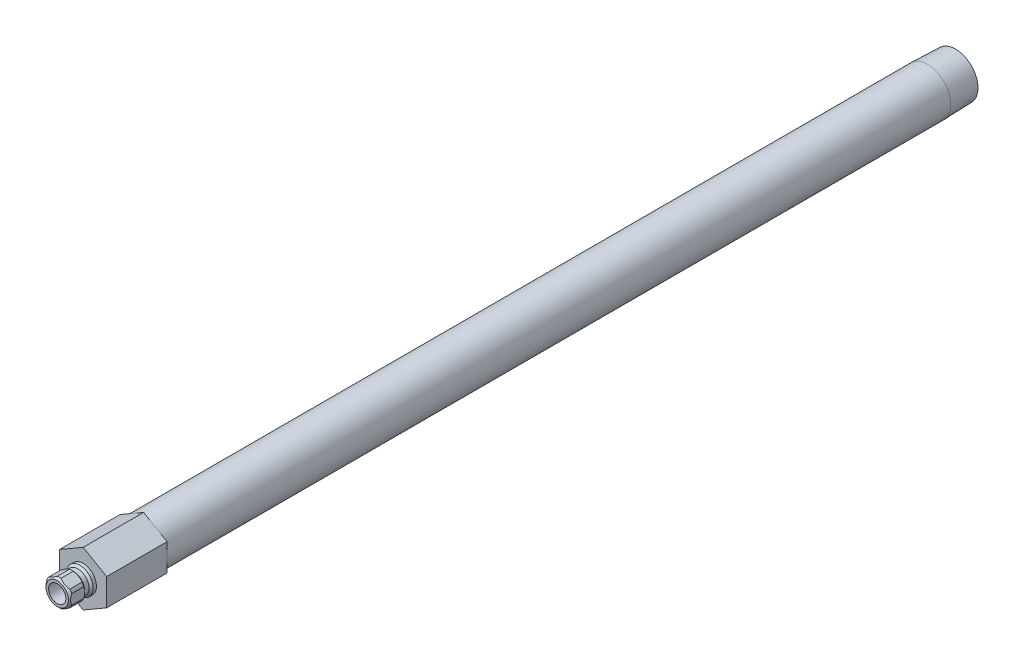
ISO-10303-21;
HEADER;
FILE_DESCRIPTION(('STEP AP214'),'2;1');
FILE_NAME('part.step','',(''),(''),'','','');
FILE_SCHEMA(('AUTOMOTIVE_DESIGN { 1 0 10303 214 1 1 1 1 }'));
ENDSEC;
DATA;
#1=APPLICATION_CONTEXT('core data for automotive mechanical design processes');
#2=APPLICATION_PROTOCOL_DEFINITION('international standard','automotive_design',2000,#1);
#3=PRODUCT_CONTEXT('',#1,'mechanical');
#4=PRODUCT('Part','Part','',(#3));
#5=PRODUCT_RELATED_PRODUCT_CATEGORY('part','',(#4));
#6=PRODUCT_DEFINITION_FORMATION('','',#4);
#7=PRODUCT_DEFINITION_CONTEXT('part definition',#1,'design');
#8=PRODUCT_DEFINITION('design','',#6,#7);
#9=PRODUCT_DEFINITION_SHAPE('','',#8);
#10=(LENGTH_UNIT() NAMED_UNIT(*) SI_UNIT(.MILLI.,.METRE.));
#11=(NAMED_UNIT(*) PLANE_ANGLE_UNIT() SI_UNIT($,.RADIAN.));
#12=(NAMED_UNIT(*) SI_UNIT($,.STERADIAN.) SOLID_ANGLE_UNIT());
#13=UNCERTAINTY_MEASURE_WITH_UNIT(LENGTH_MEASURE(1.E-05),#10,'distance_accuracy_value','');
#14=(GEOMETRIC_REPRESENTATION_CONTEXT(3) GLOBAL_UNCERTAINTY_ASSIGNED_CONTEXT((#13)) GLOBAL_UNIT_ASSIGNED_CONTEXT((#10,
#11,#12)) REPRESENTATION_CONTEXT('',''));
#15=CARTESIAN_POINT('',(0.,0.,0.));
#16=DIRECTION('',(0.,0.,1.));
#17=DIRECTION('',(1.,0.,0.));
#18=AXIS2_PLACEMENT_3D('',#15,#16,#17);
#19=CARTESIAN_POINT('',(0.,0.,0.));
#20=DIRECTION('',(0.,0.,-1.));
#21=DIRECTION('',(0.,1.,0.));
#22=AXIS2_PLACEMENT_3D('',#19,#20,#21);
#23=CYLINDRICAL_SURFACE('',#22,4.8895);
#24=DIRECTION('',(0.,0.,-1.));
#25=VECTOR('',#24,1.);
#26=CARTESIAN_POINT('',(4.5212,1.86170910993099,0.));
#27=LINE('',#26,#25);
#28=CARTESIAN_POINT('',(4.5212,1.86170910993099,4.318));
#29=VERTEX_POINT('',#28);
#30=CARTESIAN_POINT('',(4.5212,1.86170910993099,8.763));
#31=VERTEX_POINT('',#30);
#32=EDGE_CURVE('E404',#29,#31,#27,.F.);
#33=ORIENTED_EDGE('',*,*,#32,.F.);
#34=CARTESIAN_POINT('',(0.,0.,4.318));
#35=DIRECTION('',(0.,0.,-1.));
#36=DIRECTION('',(0.,1.,0.));
#37=AXIS2_PLACEMENT_3D('',#34,#35,#36);
#38=CIRCLE('',#37,4.8895);
#39=CARTESIAN_POINT('',(3.87288738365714,2.98461950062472,4.318));
#40=VERTEX_POINT('',#39);
#41=EDGE_CURVE('E206',#40,#29,#38,.T.);
#42=ORIENTED_EDGE('',*,*,#41,.F.);
#43=DIRECTION('',(0.,0.,-1.));
#44=VECTOR('',#43,1.);
#45=CARTESIAN_POINT('',(3.87288738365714,2.98461950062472,0.));
#46=LINE('',#45,#44);
#47=CARTESIAN_POINT('',(3.87288738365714,2.98461950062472,8.763));
#48=VERTEX_POINT('',#47);
#49=EDGE_CURVE('E392',#48,#40,#46,.T.);
#50=ORIENTED_EDGE('',*,*,#49,.F.);
#51=CARTESIAN_POINT('',(0.,0.,8.763));
#52=DIRECTION('',(0.,0.,-1.));
#53=DIRECTION('',(0.,1.,0.));
#54=AXIS2_PLACEMENT_3D('',#51,#52,#53);
#55=CIRCLE('',#54,4.8895);
#56=EDGE_CURVE('E193',#48,#31,#55,.T.);
#57=ORIENTED_EDGE('',*,*,#56,.T.);
#58=EDGE_LOOP('',(#33,#42,#50,#57));
#59=FACE_BOUND('',#58,.T.);
#60=ADVANCED_FACE('F34',(#59),#23,.T.);
#61=DIRECTION('',(0.,0.,-1.));
#62=VECTOR('',#61,1.);
#63=CARTESIAN_POINT('',(0.648312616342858,4.84632861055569,0.));
#64=LINE('',#63,#62);
#65=CARTESIAN_POINT('',(0.648312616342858,4.84632861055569,4.318));
#66=VERTEX_POINT('',#65);
#67=CARTESIAN_POINT('',(0.648312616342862,4.84632861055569,8.763));
#68=VERTEX_POINT('',#67);
#69=EDGE_CURVE('E311',#66,#68,#64,.F.);
#70=ORIENTED_EDGE('',*,*,#69,.F.);
#71=CARTESIAN_POINT('',(-0.648312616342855,4.84632861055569,4.318));
#72=VERTEX_POINT('',#71);
#73=EDGE_CURVE('E202',#72,#66,#38,.T.);
#74=ORIENTED_EDGE('',*,*,#73,.F.);
#75=DIRECTION('',(0.,0.,-1.));
#76=VECTOR('',#75,1.);
#77=CARTESIAN_POINT('',(-0.648312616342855,4.84632861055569,0.));
#78=LINE('',#77,#76);
#79=CARTESIAN_POINT('',(-0.648312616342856,4.84632861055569,8.763));
#80=VERTEX_POINT('',#79);
#81=EDGE_CURVE('E391',#80,#72,#78,.T.);
#82=ORIENTED_EDGE('',*,*,#81,.F.);
#83=EDGE_CURVE('E196',#80,#68,#55,.T.);
#84=ORIENTED_EDGE('',*,*,#83,.T.);
#85=EDGE_LOOP('',(#70,#74,#82,#84));
#86=FACE_BOUND('',#85,.T.);
#87=ADVANCED_FACE('F345',(#86),#23,.T.);
#88=DIRECTION('',(0.,0.,-1.));
#89=VECTOR('',#88,1.);
#90=CARTESIAN_POINT('',(-3.87288738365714,2.98461950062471,0.));
#91=LINE('',#90,#89);
#92=CARTESIAN_POINT('',(-3.87288738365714,2.98461950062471,4.318));
#93=VERTEX_POINT('',#92);
#94=CARTESIAN_POINT('',(-3.87288738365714,2.98461950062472,8.763));
#95=VERTEX_POINT('',#94);
#96=EDGE_CURVE('E54',#93,#95,#91,.F.);
#97=ORIENTED_EDGE('',*,*,#96,.F.);
#98=CARTESIAN_POINT('',(-4.5212,1.86170910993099,4.318));
#99=VERTEX_POINT('',#98);
#100=EDGE_CURVE('E205',#99,#93,#38,.T.);
#101=ORIENTED_EDGE('',*,*,#100,.F.);
#102=DIRECTION('',(0.,0.,-1.));
#103=VECTOR('',#102,1.);
#104=CARTESIAN_POINT('',(-4.5212,1.86170910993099,0.));
#105=LINE('',#104,#103);
#106=CARTESIAN_POINT('',(-4.5212,1.86170910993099,8.763));
#107=VERTEX_POINT('',#106);
#108=EDGE_CURVE('E378',#107,#99,#105,.T.);
#109=ORIENTED_EDGE('',*,*,#108,.F.);
#110=EDGE_CURVE('E195',#107,#95,#55,.T.);
#111=ORIENTED_EDGE('',*,*,#110,.T.);
#112=EDGE_LOOP('',(#97,#101,#109,#111));
#113=FACE_BOUND('',#112,.T.);
#114=ADVANCED_FACE('F350',(#113),#23,.T.);
#115=DIRECTION('',(0.,0.,-1.));
#116=VECTOR('',#115,1.);
#117=CARTESIAN_POINT('',(-4.5212,-1.86170910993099,0.));
#118=LINE('',#117,#116);
#119=CARTESIAN_POINT('',(-4.5212,-1.86170910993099,4.318));
#120=VERTEX_POINT('',#119);
#121=CARTESIAN_POINT('',(-4.5212,-1.86170910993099,8.763));
#122=VERTEX_POINT('',#121);
#123=EDGE_CURVE('E62',#120,#122,#118,.F.);
#124=ORIENTED_EDGE('',*,*,#123,.F.);
#125=CARTESIAN_POINT('',(-3.87288738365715,-2.98461950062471,4.318));
#126=VERTEX_POINT('',#125);
#127=EDGE_CURVE('E377',#126,#120,#38,.T.);
#128=ORIENTED_EDGE('',*,*,#127,.F.);
#129=DIRECTION('',(0.,0.,-1.));
#130=VECTOR('',#129,1.);
#131=CARTESIAN_POINT('',(-3.87288738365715,-2.98461950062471,0.));
#132=LINE('',#131,#130);
#133=CARTESIAN_POINT('',(-3.87288738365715,-2.98461950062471,8.763));
#134=VERTEX_POINT('',#133);
#135=EDGE_CURVE('E265',#134,#126,#132,.T.);
#136=ORIENTED_EDGE('',*,*,#135,.F.);
#137=EDGE_CURVE('E191',#134,#122,#55,.T.);
#138=ORIENTED_EDGE('',*,*,#137,.T.);
#139=EDGE_LOOP('',(#124,#128,#136,#138));
#140=FACE_BOUND('',#139,.T.);
#141=ADVANCED_FACE('F362',(#140),#23,.T.);
#142=DIRECTION('',(0.,0.,-1.));
#143=VECTOR('',#142,1.);
#144=CARTESIAN_POINT('',(-0.648312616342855,-4.84632861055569,0.));
#145=LINE('',#144,#143);
#146=CARTESIAN_POINT('',(-0.648312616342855,-4.84632861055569,4.318));
#147=VERTEX_POINT('',#146);
#148=CARTESIAN_POINT('',(-0.648312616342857,-4.84632861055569,8.763));
#149=VERTEX_POINT('',#148);
#150=EDGE_CURVE('E394',#147,#149,#145,.F.);
#151=ORIENTED_EDGE('',*,*,#150,.F.);
#152=CARTESIAN_POINT('',(0.648312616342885,-4.84632861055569,4.318));
#153=VERTEX_POINT('',#152);
#154=EDGE_CURVE('E183',#153,#147,#38,.T.);
#155=ORIENTED_EDGE('',*,*,#154,.F.);
#156=DIRECTION('',(0.,0.,-1.));
#157=VECTOR('',#156,1.);
#158=CARTESIAN_POINT('',(0.648312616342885,-4.84632861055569,0.));
#159=LINE('',#158,#157);
#160=CARTESIAN_POINT('',(0.648312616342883,-4.84632861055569,8.763));
#161=VERTEX_POINT('',#160);
#162=EDGE_CURVE('E165',#161,#153,#159,.T.);
#163=ORIENTED_EDGE('',*,*,#162,.F.);
#164=EDGE_CURVE('E181',#161,#149,#55,.T.);
#165=ORIENTED_EDGE('',*,*,#164,.T.);
#166=EDGE_LOOP('',(#151,#155,#163,#165));
#167=FACE_BOUND('',#166,.T.);
#168=ADVANCED_FACE('F180',(#167),#23,.T.);
#169=CARTESIAN_POINT('',(0.,0.,0.));
#170=DIRECTION('',(0.,0.,-1.));
#171=DIRECTION('',(0.,1.,0.));
#172=AXIS2_PLACEMENT_3D('',#169,#170,#171);
#173=CYLINDRICAL_SURFACE('',#172,8.57249999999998);
#174=CARTESIAN_POINT('',(0.,0.,-310.3372));
#175=DIRECTION('',(0.,0.,-1.));
#176=DIRECTION('',(0.,1.,0.));
#177=AXIS2_PLACEMENT_3D('',#174,#175,#176);
#178=CIRCLE('',#177,8.57249999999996);
#179=CARTESIAN_POINT('',(0.,8.5725,-310.3372));
#180=VERTEX_POINT('',#179);
#181=EDGE_CURVE('E219',#180,#180,#178,.T.);
#182=ORIENTED_EDGE('',*,*,#181,.F.);
#183=EDGE_LOOP('',(#182));
#184=FACE_BOUND('',#183,.T.);
#185=CARTESIAN_POINT('',(0.,0.,-22.225));
#186=DIRECTION('',(0.,0.,1.));
#187=DIRECTION('',(1.,0.,0.));
#188=AXIS2_PLACEMENT_3D('',#185,#186,#187);
#189=CIRCLE('',#188,8.57249999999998);
#190=CARTESIAN_POINT('',(8.57249999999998,0.,-22.225));
#191=VERTEX_POINT('',#190);
#192=EDGE_CURVE('E233',#191,#191,#189,.F.);
#193=ORIENTED_EDGE('',*,*,#192,.T.);
#194=EDGE_LOOP('',(#193));
#195=FACE_BOUND('',#194,.T.);
#196=ADVANCED_FACE('F361',(#184,#195),#173,.T.);
#197=CARTESIAN_POINT('',(0.,0.,0.));
#198=DIRECTION('',(0.,0.,-1.));
#199=DIRECTION('',(0.,1.,0.));
#200=AXIS2_PLACEMENT_3D('',#197,#198,#199);
#201=CYLINDRICAL_SURFACE('',#200,3.175);
#202=CARTESIAN_POINT('',(0.,0.,9.525));
#203=DIRECTION('',(0.,0.,-1.));
#204=DIRECTION('',(0.,1.,0.));
#205=AXIS2_PLACEMENT_3D('',#202,#203,#204);
#206=CIRCLE('',#205,3.175);
#207=CARTESIAN_POINT('',(0.,3.175,9.525));
#208=VERTEX_POINT('',#207);
#209=EDGE_CURVE('E235',#208,#208,#206,.T.);
#210=ORIENTED_EDGE('',*,*,#209,.F.);
#211=EDGE_LOOP('',(#210));
#212=FACE_BOUND('',#211,.T.);
#213=CARTESIAN_POINT('',(0.,0.,-22.225));
#214=DIRECTION('',(0.,0.,-1.));
#215=DIRECTION('',(0.,1.,0.));
#216=AXIS2_PLACEMENT_3D('',#213,#214,#215);
#217=CIRCLE('',#216,3.175);
#218=CARTESIAN_POINT('',(0.,3.175,-22.225));
#219=VERTEX_POINT('',#218);
#220=EDGE_CURVE('E174',#219,#219,#217,.T.);
#221=ORIENTED_EDGE('',*,*,#220,.T.);
#222=EDGE_LOOP('',(#221));
#223=FACE_BOUND('',#222,.T.);
#224=ADVANCED_FACE('F36',(#212,#223),#201,.F.);
#225=CARTESIAN_POINT('',(0.,3.175,-22.225));
#226=DIRECTION('',(0.,0.,-1.));
#227=DIRECTION('',(0.,1.,0.));
#228=AXIS2_PLACEMENT_3D('',#225,#226,#227);
#229=PLANE('',#228);
#230=CARTESIAN_POINT('',(0.,0.,-22.225));
#231=DIRECTION('',(0.,0.,-1.));
#232=DIRECTION('',(0.,1.,0.));
#233=AXIS2_PLACEMENT_3D('',#230,#231,#232);
#234=CIRCLE('',#233,6.2611);
#235=CARTESIAN_POINT('',(0.,6.2611,-22.225));
#236=VERTEX_POINT('',#235);
#237=EDGE_CURVE('E228',#236,#236,#234,.T.);
#238=ORIENTED_EDGE('',*,*,#237,.T.);
#239=EDGE_LOOP('',(#238));
#240=FACE_BOUND('',#239,.T.);
#241=ORIENTED_EDGE('',*,*,#220,.F.);
#242=EDGE_LOOP('',(#241));
#243=FACE_BOUND('',#242,.T.);
#244=ADVANCED_FACE('F533',(#240,#243),#229,.T.);
#245=CARTESIAN_POINT('',(0.,0.,0.));
#246=DIRECTION('',(0.,0.,-1.));
#247=DIRECTION('',(0.,1.,0.));
#248=AXIS2_PLACEMENT_3D('',#245,#246,#247);
#249=CYLINDRICAL_SURFACE('',#248,6.26109999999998);
#250=CARTESIAN_POINT('',(0.,0.,-320.675));
#251=DIRECTION('',(0.,0.,-1.));
#252=DIRECTION('',(0.,1.,0.));
#253=AXIS2_PLACEMENT_3D('',#250,#251,#252);
#254=CIRCLE('',#253,6.26109999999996);
#255=CARTESIAN_POINT('',(0.,6.2611,-320.675));
#256=VERTEX_POINT('',#255);
#257=EDGE_CURVE('E225',#256,#256,#254,.T.);
#258=ORIENTED_EDGE('',*,*,#257,.T.);
#259=EDGE_LOOP('',(#258));
#260=FACE_BOUND('',#259,.T.);
#261=ORIENTED_EDGE('',*,*,#237,.F.);
#262=EDGE_LOOP('',(#261));
#263=FACE_BOUND('',#262,.T.);
#264=ADVANCED_FACE('F530',(#260,#263),#249,.F.);
#265=CARTESIAN_POINT('',(0.,8.24944566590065,-320.675));
#266=DIRECTION('',(0.,0.,-1.));
#267=DIRECTION('',(0.,1.,0.));
#268=AXIS2_PLACEMENT_3D('',#265,#266,#267);
#269=PLANE('',#268);
#270=CARTESIAN_POINT('',(0.,0.,-320.675));
#271=DIRECTION('',(0.,0.,-1.));
#272=DIRECTION('',(0.,1.,0.));
#273=AXIS2_PLACEMENT_3D('',#270,#271,#272);
#274=CIRCLE('',#273,8.24944566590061);
#275=CARTESIAN_POINT('',(0.,8.24944566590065,-320.675));
#276=VERTEX_POINT('',#275);
#277=EDGE_CURVE('E222',#276,#276,#274,.T.);
#278=ORIENTED_EDGE('',*,*,#277,.T.);
#279=EDGE_LOOP('',(#278));
#280=FACE_BOUND('',#279,.T.);
#281=ORIENTED_EDGE('',*,*,#257,.F.);
#282=EDGE_LOOP('',(#281));
#283=FACE_BOUND('',#282,.T.);
#284=ADVANCED_FACE('F524',(#280,#283),#269,.T.);
#285=CARTESIAN_POINT('',(0.,0.,-320.675));
#286=DIRECTION('',(0.,0.,1.));
#287=DIRECTION('',(0.,-1.,0.));
#288=AXIS2_PLACEMENT_3D('',#285,#286,#287);
#289=CONICAL_SURFACE('',#288,8.24944566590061,0.0312396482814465);
#290=ORIENTED_EDGE('',*,*,#181,.T.);
#291=EDGE_LOOP('',(#290));
#292=FACE_BOUND('',#291,.T.);
#293=ORIENTED_EDGE('',*,*,#277,.F.);
#294=EDGE_LOOP('',(#293));
#295=FACE_BOUND('',#294,.T.);
#296=ADVANCED_FACE('F514',(#292,#295),#289,.T.);
#297=CARTESIAN_POINT('',(0.,4.8895,0.));
#298=DIRECTION('',(0.,0.,1.));
#299=DIRECTION('',(0.,-1.,0.));
#300=AXIS2_PLACEMENT_3D('',#297,#298,#299);
#301=PLANE('',#300);
#302=CARTESIAN_POINT('',(0.,0.,0.));
#303=DIRECTION('',(0.,0.,-1.));
#304=DIRECTION('',(0.,1.,0.));
#305=AXIS2_PLACEMENT_3D('',#302,#303,#304);
#306=CIRCLE('',#305,4.8895);
#307=CARTESIAN_POINT('',(0.,4.8895,0.));
#308=VERTEX_POINT('',#307);
#309=EDGE_CURVE('E216',#308,#308,#306,.T.);
#310=ORIENTED_EDGE('',*,*,#309,.T.);
#311=EDGE_LOOP('',(#310));
#312=FACE_BOUND('',#311,.T.);
#313=DIRECTION('',(-0.866025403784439,-0.5,0.));
#314=VECTOR('',#313,1.);
#315=CARTESIAN_POINT('',(0.,9.97199384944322,0.));
#316=LINE('',#315,#314);
#317=CARTESIAN_POINT('',(0.,9.97199384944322,0.));
#318=VERTEX_POINT('',#317);
#319=CARTESIAN_POINT('',(-8.636,4.98599692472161,0.));
#320=VERTEX_POINT('',#319);
#321=EDGE_CURVE('E409',#318,#320,#316,.T.);
#322=ORIENTED_EDGE('',*,*,#321,.T.);
#323=DIRECTION('',(0.,-1.,0.));
#324=VECTOR('',#323,1.);
#325=CARTESIAN_POINT('',(-8.636,4.98599692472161,0.));
#326=LINE('',#325,#324);
#327=CARTESIAN_POINT('',(-8.636,-4.98599692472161,0.));
#328=VERTEX_POINT('',#327);
#329=EDGE_CURVE('E436',#320,#328,#326,.T.);
#330=ORIENTED_EDGE('',*,*,#329,.T.);
#331=DIRECTION('',(0.866025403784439,-0.5,0.));
#332=VECTOR('',#331,1.);
#333=CARTESIAN_POINT('',(-8.636,-4.98599692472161,0.));
#334=LINE('',#333,#332);
#335=CARTESIAN_POINT('',(0.,-9.97199384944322,0.));
#336=VERTEX_POINT('',#335);
#337=EDGE_CURVE('E439',#328,#336,#334,.T.);
#338=ORIENTED_EDGE('',*,*,#337,.T.);
#339=DIRECTION('',(0.866025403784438,0.5,0.));
#340=VECTOR('',#339,1.);
#341=CARTESIAN_POINT('',(0.,-9.97199384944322,0.));
#342=LINE('',#341,#340);
#343=CARTESIAN_POINT('',(8.636,-4.98599692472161,0.));
#344=VERTEX_POINT('',#343);
#345=EDGE_CURVE('E442',#336,#344,#342,.T.);
#346=ORIENTED_EDGE('',*,*,#345,.T.);
#347=DIRECTION('',(0.,1.,0.));
#348=VECTOR('',#347,1.);
#349=CARTESIAN_POINT('',(8.636,-4.98599692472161,0.));
#350=LINE('',#349,#348);
#351=CARTESIAN_POINT('',(8.636,4.98599692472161,0.));
#352=VERTEX_POINT('',#351);
#353=EDGE_CURVE('E445',#344,#352,#350,.T.);
#354=ORIENTED_EDGE('',*,*,#353,.T.);
#355=DIRECTION('',(-0.866025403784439,0.5,0.));
#356=VECTOR('',#355,1.);
#357=CARTESIAN_POINT('',(8.636,4.98599692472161,0.));
#358=LINE('',#357,#356);
#359=EDGE_CURVE('E418',#352,#318,#358,.T.);
#360=ORIENTED_EDGE('',*,*,#359,.T.);
#361=EDGE_LOOP('',(#322,#330,#338,#346,#354,#360));
#362=FACE_BOUND('',#361,.T.);
#363=ADVANCED_FACE('F511',(#312,#362),#301,.T.);
#364=CARTESIAN_POINT('',(0.,0.,0.));
#365=DIRECTION('',(0.,0.,-1.));
#366=DIRECTION('',(0.,1.,0.));
#367=AXIS2_PLACEMENT_3D('',#364,#365,#366);
#368=CYLINDRICAL_SURFACE('',#367,4.8895);
#369=CARTESIAN_POINT('',(0.,0.,1.2065));
#370=DIRECTION('',(0.,0.,-1.));
#371=DIRECTION('',(0.,1.,0.));
#372=AXIS2_PLACEMENT_3D('',#369,#370,#371);
#373=CIRCLE('',#372,4.8895);
#374=CARTESIAN_POINT('',(0.,4.8895,1.2065));
#375=VERTEX_POINT('',#374);
#376=EDGE_CURVE('E213',#375,#375,#373,.T.);
#377=ORIENTED_EDGE('',*,*,#376,.T.);
#378=EDGE_LOOP('',(#377));
#379=FACE_BOUND('',#378,.T.);
#380=ORIENTED_EDGE('',*,*,#309,.F.);
#381=EDGE_LOOP('',(#380));
#382=FACE_BOUND('',#381,.T.);
#383=ADVANCED_FACE('F513',(#379,#382),#368,.T.);
#384=CARTESIAN_POINT('',(0.,0.,1.2065));
#385=DIRECTION('',(0.,0.,-1.));
#386=DIRECTION('',(0.,1.,0.));
#387=AXIS2_PLACEMENT_3D('',#384,#385,#386);
#388=CONICAL_SURFACE('',#387,4.8895,0.785398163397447);
#389=CARTESIAN_POINT('',(0.,0.,1.9685));
#390=DIRECTION('',(0.,0.,-1.));
#391=DIRECTION('',(0.,1.,0.));
#392=AXIS2_PLACEMENT_3D('',#389,#390,#391);
#393=CIRCLE('',#392,4.1275);
#394=CARTESIAN_POINT('',(0.,4.1275,1.9685));
#395=VERTEX_POINT('',#394);
#396=EDGE_CURVE('E210',#395,#395,#393,.T.);
#397=ORIENTED_EDGE('',*,*,#396,.T.);
#398=EDGE_LOOP('',(#397));
#399=FACE_BOUND('',#398,.T.);
#400=ORIENTED_EDGE('',*,*,#376,.F.);
#401=EDGE_LOOP('',(#400));
#402=FACE_BOUND('',#401,.T.);
#403=ADVANCED_FACE('F521',(#399,#402),#388,.T.);
#404=CARTESIAN_POINT('',(0.,0.,0.));
#405=DIRECTION('',(0.,0.,-1.));
#406=DIRECTION('',(0.,1.,0.));
#407=AXIS2_PLACEMENT_3D('',#404,#405,#406);
#408=CYLINDRICAL_SURFACE('',#407,4.1275);
#409=CARTESIAN_POINT('',(0.,0.,3.556));
#410=DIRECTION('',(0.,0.,-1.));
#411=DIRECTION('',(0.,1.,0.));
#412=AXIS2_PLACEMENT_3D('',#409,#410,#411);
#413=CIRCLE('',#412,4.1275);
#414=CARTESIAN_POINT('',(0.,4.1275,3.556));
#415=VERTEX_POINT('',#414);
#416=EDGE_CURVE('E207',#415,#415,#413,.T.);
#417=ORIENTED_EDGE('',*,*,#416,.T.);
#418=EDGE_LOOP('',(#417));
#419=FACE_BOUND('',#418,.T.);
#420=ORIENTED_EDGE('',*,*,#396,.F.);
#421=EDGE_LOOP('',(#420));
#422=FACE_BOUND('',#421,.T.);
#423=ADVANCED_FACE('F272',(#419,#422),#408,.T.);
#424=CARTESIAN_POINT('',(0.,0.,3.556));
#425=DIRECTION('',(0.,0.,1.));
#426=DIRECTION('',(0.,-1.,0.));
#427=AXIS2_PLACEMENT_3D('',#424,#425,#426);
#428=CONICAL_SURFACE('',#427,4.1275,0.785398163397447);
#429=CARTESIAN_POINT('',(4.52119999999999,-5.15925306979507,6.28846659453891));
#430=CARTESIAN_POINT('',(4.52119999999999,-5.03341781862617,6.19384981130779));
#431=CARTESIAN_POINT('',(4.52119999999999,-4.90687282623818,6.100161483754));
#432=CARTESIAN_POINT('',(4.52119999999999,-4.65208542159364,5.91505573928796));
#433=CARTESIAN_POINT('',(4.52119999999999,-4.52384258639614,5.8236389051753));
#434=CARTESIAN_POINT('',(4.52119999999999,-4.26444371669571,5.64284060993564));
#435=CARTESIAN_POINT('',(4.52119999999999,-4.1332728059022,5.5534804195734));
#436=CARTESIAN_POINT('',(4.52119999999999,-3.86869655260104,5.37814219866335));
#437=CARTESIAN_POINT('',(4.52119999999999,-3.73529136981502,5.29216392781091));
#438=CARTESIAN_POINT('',(4.52119999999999,-3.45835736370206,5.11964219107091));
#439=CARTESIAN_POINT('',(4.52119999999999,-3.31467977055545,5.03333631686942));
#440=CARTESIAN_POINT('',(4.52119999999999,-3.02397608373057,4.86646929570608));
#441=CARTESIAN_POINT('',(4.52119999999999,-2.87694947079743,4.78590904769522));
#442=CARTESIAN_POINT('',(4.52119999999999,-2.57957206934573,4.6322757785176));
#443=CARTESIAN_POINT('',(4.52119999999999,-2.42923274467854,4.55918074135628));
#444=CARTESIAN_POINT('',(4.52119999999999,-2.12448469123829,4.4221138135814));
#445=CARTESIAN_POINT('',(4.52119999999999,-1.97007782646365,4.35813782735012));
#446=CARTESIAN_POINT('',(4.52119999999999,-1.66898205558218,4.24604782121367));
#447=CARTESIAN_POINT('',(4.52119999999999,-1.52260919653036,4.19709368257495));
#448=CARTESIAN_POINT('',(4.52119999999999,-1.22638031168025,4.11093488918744));
#449=CARTESIAN_POINT('',(4.52119999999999,-1.07652404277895,4.07373105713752));
#450=CARTESIAN_POINT('',(4.52119999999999,-0.776693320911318,4.01362130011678));
#451=CARTESIAN_POINT('',(4.52119999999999,-0.626768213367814,3.99047322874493));
#452=CARTESIAN_POINT('',(4.52119999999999,-0.325366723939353,3.95891692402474));
#453=CARTESIAN_POINT('',(4.52119999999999,-0.173890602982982,3.95050625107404));
#454=CARTESIAN_POINT('',(4.52119999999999,0.123852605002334,3.94903068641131));
#455=CARTESIAN_POINT('',(4.52119999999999,0.270117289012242,3.95544130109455));
#456=CARTESIAN_POINT('',(4.52119999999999,0.561370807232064,3.98210770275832));
#457=CARTESIAN_POINT('',(4.5212,0.706359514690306,4.0023648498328));
#458=CARTESIAN_POINT('',(4.5212,0.996462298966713,4.05597163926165));
#459=CARTESIAN_POINT('',(4.5212,1.14153485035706,4.08954247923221));
#460=CARTESIAN_POINT('',(4.5212,1.42852462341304,4.1680002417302));
#461=CARTESIAN_POINT('',(4.5212,1.57044212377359,4.21288616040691));
#462=CARTESIAN_POINT('',(4.5212,1.86505501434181,4.31714129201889));
#463=CARTESIAN_POINT('',(4.5212,2.01739126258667,4.377515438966));
#464=CARTESIAN_POINT('',(4.5212,2.31809735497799,4.50751823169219));
#465=CARTESIAN_POINT('',(4.5212,2.46646529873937,4.57715121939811));
#466=CARTESIAN_POINT('',(4.5212,2.75996557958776,4.72401353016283));
#467=CARTESIAN_POINT('',(4.5212,2.9050858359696,4.80126680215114));
#468=CARTESIAN_POINT('',(4.5212,3.19198335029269,4.96166050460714));
#469=CARTESIAN_POINT('',(4.5212,3.33376113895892,5.04479999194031));
#470=CARTESIAN_POINT('',(4.5212,3.60742153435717,5.21154136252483));
#471=CARTESIAN_POINT('',(4.5212,3.73944496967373,5.29491333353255));
#472=CARTESIAN_POINT('',(4.5212,4.00122581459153,5.46515273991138));
#473=CARTESIAN_POINT('',(4.5212,4.13098305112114,5.55202044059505));
#474=CARTESIAN_POINT('',(4.5212,4.38747396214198,5.72790624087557));
#475=CARTESIAN_POINT('',(4.5212,4.51422365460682,5.81690106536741));
#476=CARTESIAN_POINT('',(4.5212,4.76599253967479,5.99723636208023));
#477=CARTESIAN_POINT('',(4.5212,4.89101219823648,6.08857618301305));
#478=CARTESIAN_POINT('',(4.5212,5.0153077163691,6.18087446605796));
#479=B_SPLINE_CURVE_WITH_KNOTS('',3,(#429,#430,#431,#432,#433,#434,#435,#436,#437,#438,#439,
#440,#441,#442,#443,#444,#445,#446,#447,#448,#449,#450,#451,#452,#453,#454,#455,#456,#457,#458,
#459,#460,#461,#462,#463,#464,#465,#466,#467,#468,#469,#470,#471,#472,#473,#474,#475,#476,#477,
#478),.UNSPECIFIED.,.F.,.F.,(4,2,2,2,2,2,2,2,2,2,2,2,2,2,2,2,2,2,2,2,2,2,2,2,4),(0.,
0.472324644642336,0.944769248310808,1.42087610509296,1.89694907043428,2.39966187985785,
2.90245317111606,3.40371602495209,3.90475303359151,4.36737130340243,4.83002195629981,
5.28445770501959,5.73881822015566,6.17734710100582,6.61591906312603,7.06210522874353,
7.5082518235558,7.99945943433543,8.49089821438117,8.98393391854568,9.4768908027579,
9.94525924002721,10.4136632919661,10.8782525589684,11.3427141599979),.UNSPECIFIED.);
#480=CARTESIAN_POINT('',(4.52119999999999,-1.861709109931,4.318));
#481=VERTEX_POINT('',#480);
#482=EDGE_CURVE('E407',#481,#29,#479,.T.);
#483=ORIENTED_EDGE('',*,*,#482,.F.);
#484=CARTESIAN_POINT('',(3.87288738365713,-2.98461950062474,4.318));
#485=VERTEX_POINT('',#484);
#486=EDGE_CURVE('E385',#481,#485,#38,.T.);
#487=ORIENTED_EDGE('',*,*,#486,.T.);
#488=CARTESIAN_POINT('',(0.647857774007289,-4.84659121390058,4.3182));
#489=CARTESIAN_POINT('',(0.775261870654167,-4.77303442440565,4.26213711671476));
#490=CARTESIAN_POINT('',(0.904457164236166,-4.69844348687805,4.21102627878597));
#491=CARTESIAN_POINT('',(1.16629518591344,-4.5472712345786,4.1207431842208));
#492=CARTESIAN_POINT('',(1.29894624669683,-4.47068510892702,4.08160338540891));
#493=CARTESIAN_POINT('',(1.56203676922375,-4.31878972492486,4.01877592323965));
#494=CARTESIAN_POINT('',(1.69238331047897,-4.24353411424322,3.99458163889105));
#495=CARTESIAN_POINT('',(1.95434729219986,-4.09228913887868,3.96102228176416));
#496=CARTESIAN_POINT('',(2.08596281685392,-4.01630088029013,3.95163757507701));
#497=CARTESIAN_POINT('',(2.3562305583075,-3.86026172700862,3.94821923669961));
#498=CARTESIAN_POINT('',(2.49489129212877,-3.78020591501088,3.95501290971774));
#499=CARTESIAN_POINT('',(2.7710334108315,-3.62077518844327,3.9851849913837));
#500=CARTESIAN_POINT('',(2.90851272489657,-3.5414014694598,4.00858815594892));
#501=CARTESIAN_POINT('',(3.18622016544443,-3.38106700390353,4.07155129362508));
#502=CARTESIAN_POINT('',(3.32634361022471,-3.30016669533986,4.11171074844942));
#503=CARTESIAN_POINT('',(3.60275664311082,-3.14057955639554,4.20550294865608));
#504=CARTESIAN_POINT('',(3.73905611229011,-3.06188702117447,4.25909654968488));
#505=CARTESIAN_POINT('',(3.87334222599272,-2.98435689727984,4.3182));
#506=B_SPLINE_CURVE_WITH_KNOTS('',3,(#488,#489,#490,#491,#492,#493,#494,#495,#496,#497,#498,
#499,#500,#501,#502,#503,#504,#505),.UNSPECIFIED.,.F.,.F.,(4,2,2,2,2,2,2,2,4),(0.,
0.472469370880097,0.946208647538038,1.40285320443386,1.85889185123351,2.33874707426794,
2.81931901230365,3.31879975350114,3.81684169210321),.UNSPECIFIED.);
#507=EDGE_CURVE('E258',#153,#485,#506,.T.);
#508=ORIENTED_EDGE('',*,*,#507,.F.);
#509=ORIENTED_EDGE('',*,*,#154,.T.);
#510=CARTESIAN_POINT('',(-3.87334222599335,-2.98435689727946,4.31820000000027));
#511=CARTESIAN_POINT('',(-3.74593812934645,-3.05791368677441,4.262137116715));
#512=CARTESIAN_POINT('',(-3.61674283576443,-3.13250462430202,4.21102627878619));
#513=CARTESIAN_POINT('',(-3.35490481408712,-3.2836768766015,4.12074318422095));
#514=CARTESIAN_POINT('',(-3.2222537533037,-3.36026300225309,4.08160338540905));
#515=CARTESIAN_POINT('',(-2.95916323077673,-3.51215838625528,4.01877592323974));
#516=CARTESIAN_POINT('',(-2.82881668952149,-3.58741399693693,3.99458163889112));
#517=CARTESIAN_POINT('',(-2.56685270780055,-3.73865897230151,3.96102228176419));
#518=CARTESIAN_POINT('',(-2.43523718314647,-3.81464723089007,3.95163757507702));
#519=CARTESIAN_POINT('',(-2.16496944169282,-3.97068638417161,3.94821923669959));
#520=CARTESIAN_POINT('',(-2.02630870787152,-4.05074219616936,3.9550129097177));
#521=CARTESIAN_POINT('',(-1.75016658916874,-4.21017292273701,3.98518499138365));
#522=CARTESIAN_POINT('',(-1.61268727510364,-4.2895466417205,4.00858815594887));
#523=CARTESIAN_POINT('',(-1.33497983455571,-4.44988110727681,4.07155129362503));
#524=CARTESIAN_POINT('',(-1.1948563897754,-4.5307814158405,4.11171074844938));
#525=CARTESIAN_POINT('',(-0.918443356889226,-4.69036855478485,4.20550294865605));
#526=CARTESIAN_POINT('',(-0.782143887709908,-4.76906109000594,4.25909654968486));
#527=CARTESIAN_POINT('',(-0.647857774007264,-4.84659121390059,4.3182));
#528=B_SPLINE_CURVE_WITH_KNOTS('',3,(#510,#511,#512,#513,#514,#515,#516,#517,#518,#519,#520,
#521,#522,#523,#524,#525,#526,#527),.UNSPECIFIED.,.F.,.F.,(4,2,2,2,2,2,2,2,4),(0.,
0.472469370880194,0.946208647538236,1.40285320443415,1.85889185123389,2.33874707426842,
2.81931901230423,3.31879975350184,3.81684169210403),.UNSPECIFIED.);
#529=EDGE_CURVE('E281',#126,#147,#528,.T.);
#530=ORIENTED_EDGE('',*,*,#529,.F.);
#531=ORIENTED_EDGE('',*,*,#127,.T.);
#532=CARTESIAN_POINT('',(-4.5212,-5.15925306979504,6.2884665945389));
#533=CARTESIAN_POINT('',(-4.5212,-5.03341781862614,6.19384981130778));
#534=CARTESIAN_POINT('',(-4.5212,-4.90687282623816,6.10016148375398));
#535=CARTESIAN_POINT('',(-4.5212,-4.65208542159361,5.91505573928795));
#536=CARTESIAN_POINT('',(-4.5212,-4.52384258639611,5.82363890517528));
#537=CARTESIAN_POINT('',(-4.5212,-4.26444371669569,5.64284060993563));
#538=CARTESIAN_POINT('',(-4.5212,-4.13327280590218,5.55348041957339));
#539=CARTESIAN_POINT('',(-4.5212,-3.86869655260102,5.37814219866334));
#540=CARTESIAN_POINT('',(-4.5212,-3.735291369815,5.2921639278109));
#541=CARTESIAN_POINT('',(-4.5212,-3.45835736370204,5.1196421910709));
#542=CARTESIAN_POINT('',(-4.5212,-3.31467977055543,5.03333631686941));
#543=CARTESIAN_POINT('',(-4.5212,-3.02397608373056,4.86646929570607));
#544=CARTESIAN_POINT('',(-4.5212,-2.87694947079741,4.78590904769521));
#545=CARTESIAN_POINT('',(-4.5212,-2.57957206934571,4.63227577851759));
#546=CARTESIAN_POINT('',(-4.5212,-2.42923274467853,4.55918074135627));
#547=CARTESIAN_POINT('',(-4.5212,-2.12448469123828,4.4221138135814));
#548=CARTESIAN_POINT('',(-4.5212,-1.97007782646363,4.35813782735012));
#549=CARTESIAN_POINT('',(-4.5212,-1.66898205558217,4.24604782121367));
#550=CARTESIAN_POINT('',(-4.5212,-1.52260919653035,4.19709368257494));
#551=CARTESIAN_POINT('',(-4.5212,-1.22638031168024,4.11093488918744));
#552=CARTESIAN_POINT('',(-4.5212,-1.07652404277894,4.07373105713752));
#553=CARTESIAN_POINT('',(-4.5212,-0.776693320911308,4.01362130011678));
#554=CARTESIAN_POINT('',(-4.5212,-0.626768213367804,3.99047322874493));
#555=CARTESIAN_POINT('',(-4.5212,-0.325366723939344,3.95891692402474));
#556=CARTESIAN_POINT('',(-4.5212,-0.173890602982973,3.95050625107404));
#557=CARTESIAN_POINT('',(-4.5212,0.123852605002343,3.94903068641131));
#558=CARTESIAN_POINT('',(-4.5212,0.270117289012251,3.95544130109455));
#559=CARTESIAN_POINT('',(-4.5212,0.561370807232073,3.98210770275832));
#560=CARTESIAN_POINT('',(-4.5212,0.706359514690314,4.0023648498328));
#561=CARTESIAN_POINT('',(-4.5212,0.996462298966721,4.05597163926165));
#562=CARTESIAN_POINT('',(-4.5212,1.14153485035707,4.08954247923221));
#563=CARTESIAN_POINT('',(-4.5212,1.42852462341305,4.16800024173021));
#564=CARTESIAN_POINT('',(-4.5212,1.5704421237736,4.21288616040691));
#565=CARTESIAN_POINT('',(-4.5212,1.86505501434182,4.31714129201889));
#566=CARTESIAN_POINT('',(-4.5212,2.01739126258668,4.377515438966));
#567=CARTESIAN_POINT('',(-4.5212,2.318097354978,4.50751823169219));
#568=CARTESIAN_POINT('',(-4.5212,2.46646529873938,4.57715121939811));
#569=CARTESIAN_POINT('',(-4.5212,2.75996557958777,4.72401353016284));
#570=CARTESIAN_POINT('',(-4.5212,2.9050858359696,4.80126680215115));
#571=CARTESIAN_POINT('',(-4.5212,3.1919833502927,4.96166050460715));
#572=CARTESIAN_POINT('',(-4.5212,3.33376113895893,5.04479999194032));
#573=CARTESIAN_POINT('',(-4.5212,3.60742153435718,5.21154136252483));
#574=CARTESIAN_POINT('',(-4.5212,3.73944496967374,5.29491333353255));
#575=CARTESIAN_POINT('',(-4.5212,4.00122581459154,5.46515273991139));
#576=CARTESIAN_POINT('',(-4.5212,4.13098305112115,5.55202044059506));
#577=CARTESIAN_POINT('',(-4.5212,4.38747396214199,5.72790624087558));
#578=CARTESIAN_POINT('',(-4.5212,4.51422365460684,5.81690106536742));
#579=CARTESIAN_POINT('',(-4.5212,4.76599253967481,5.99723636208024));
#580=CARTESIAN_POINT('',(-4.5212,4.89101219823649,6.08857618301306));
#581=CARTESIAN_POINT('',(-4.5212,5.01530771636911,6.18087446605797));
#582=B_SPLINE_CURVE_WITH_KNOTS('',3,(#532,#533,#534,#535,#536,#537,#538,#539,#540,#541,#542,
#543,#544,#545,#546,#547,#548,#549,#550,#551,#552,#553,#554,#555,#556,#557,#558,#559,#560,#561,
#562,#563,#564,#565,#566,#567,#568,#569,#570,#571,#572,#573,#574,#575,#576,#577,#578,#579,#580,
#581),.UNSPECIFIED.,.F.,.F.,(4,2,2,2,2,2,2,2,2,2,2,2,2,2,2,2,2,2,2,2,2,2,2,2,4),(0.,
0.472324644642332,0.944769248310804,1.42087610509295,1.89694907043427,2.39966187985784,
2.90245317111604,3.40371602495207,3.90475303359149,4.36737130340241,4.83002195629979,
5.28445770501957,5.73881822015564,6.1773471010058,6.615919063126,7.06210522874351,
7.50825182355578,7.9994594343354,8.49089821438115,8.98393391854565,9.47689080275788,
9.94525924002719,10.4136632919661,10.8782525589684,11.3427141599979),.UNSPECIFIED.);
#583=EDGE_CURVE('E288',#99,#120,#582,.F.);
#584=ORIENTED_EDGE('',*,*,#583,.F.);
#585=ORIENTED_EDGE('',*,*,#100,.T.);
#586=CARTESIAN_POINT('',(-0.647857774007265,4.84659121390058,4.3182));
#587=CARTESIAN_POINT('',(-0.775261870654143,4.77303442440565,4.26213711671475));
#588=CARTESIAN_POINT('',(-0.904457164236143,4.69844348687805,4.21102627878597));
#589=CARTESIAN_POINT('',(-1.16629518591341,4.5472712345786,4.12074318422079));
#590=CARTESIAN_POINT('',(-1.2989462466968,4.47068510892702,4.08160338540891));
#591=CARTESIAN_POINT('',(-1.56203676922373,4.31878972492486,4.01877592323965));
#592=CARTESIAN_POINT('',(-1.69238331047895,4.24353411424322,3.99458163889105));
#593=CARTESIAN_POINT('',(-1.95434729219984,4.09228913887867,3.96102228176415));
#594=CARTESIAN_POINT('',(-2.0859628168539,4.01630088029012,3.95163757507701));
#595=CARTESIAN_POINT('',(-2.35623055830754,3.86026172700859,3.9482192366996));
#596=CARTESIAN_POINT('',(-2.49489129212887,3.78020591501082,3.95501290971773));
#597=CARTESIAN_POINT('',(-2.7710334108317,3.62077518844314,3.98518499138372));
#598=CARTESIAN_POINT('',(-2.90851272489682,3.54140146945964,4.00858815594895));
#599=CARTESIAN_POINT('',(-3.18622016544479,3.38106700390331,4.07155129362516));
#600=CARTESIAN_POINT('',(-3.32634361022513,3.3001666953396,4.11171074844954));
#601=CARTESIAN_POINT('',(-3.60275664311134,3.14057955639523,4.20550294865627));
#602=CARTESIAN_POINT('',(-3.73905611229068,3.06188702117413,4.2590965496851));
#603=CARTESIAN_POINT('',(-3.87334222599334,2.98435689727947,4.31820000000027));
#604=B_SPLINE_CURVE_WITH_KNOTS('',3,(#586,#587,#588,#589,#590,#591,#592,#593,#594,#595,#596,
#597,#598,#599,#600,#601,#602,#603),.UNSPECIFIED.,.F.,.F.,(4,2,2,2,2,2,2,2,4),(0.,
0.472469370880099,0.946208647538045,1.40285320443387,1.85889185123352,2.33874707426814,
2.81931901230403,3.31879975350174,3.81684169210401),.UNSPECIFIED.);
#605=EDGE_CURVE('E295',#72,#93,#604,.T.);
#606=ORIENTED_EDGE('',*,*,#605,.F.);
#607=ORIENTED_EDGE('',*,*,#73,.T.);
#608=CARTESIAN_POINT('',(3.87334222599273,2.98435689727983,4.3182));
#609=CARTESIAN_POINT('',(3.74593812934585,3.05791368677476,4.26213711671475));
#610=CARTESIAN_POINT('',(3.61674283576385,3.13250462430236,4.21102627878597));
#611=CARTESIAN_POINT('',(3.35490481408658,3.28367687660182,4.12074318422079));
#612=CARTESIAN_POINT('',(3.22225375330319,3.3602630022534,4.08160338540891));
#613=CARTESIAN_POINT('',(2.95916323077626,3.51215838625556,4.01877592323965));
#614=CARTESIAN_POINT('',(2.82881668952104,3.58741399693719,3.99458163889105));
#615=CARTESIAN_POINT('',(2.56685270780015,3.73865897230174,3.96102228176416));
#616=CARTESIAN_POINT('',(2.4352371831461,3.81464723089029,3.95163757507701));
#617=CARTESIAN_POINT('',(2.16496944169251,3.97068638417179,3.94821923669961));
#618=CARTESIAN_POINT('',(2.02630870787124,4.05074219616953,3.95501290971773));
#619=CARTESIAN_POINT('',(1.75016658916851,4.21017292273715,3.98518499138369));
#620=CARTESIAN_POINT('',(1.61268727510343,4.28954664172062,4.00858815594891));
#621=CARTESIAN_POINT('',(1.33497983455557,4.44988110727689,4.07155129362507));
#622=CARTESIAN_POINT('',(1.19485638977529,4.53078141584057,4.11171074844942));
#623=CARTESIAN_POINT('',(0.918443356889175,4.69036855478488,4.20550294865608));
#624=CARTESIAN_POINT('',(0.782143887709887,4.76906109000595,4.25909654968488));
#625=CARTESIAN_POINT('',(0.64785777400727,4.84659121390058,4.3182));
#626=B_SPLINE_CURVE_WITH_KNOTS('',3,(#608,#609,#610,#611,#612,#613,#614,#615,#616,#617,#618,
#619,#620,#621,#622,#623,#624,#625),.UNSPECIFIED.,.F.,.F.,(4,2,2,2,2,2,2,2,4),(0.,
0.472469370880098,0.946208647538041,1.40285320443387,1.85889185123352,2.33874707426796,
2.81931901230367,3.31879975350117,3.81684169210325),.UNSPECIFIED.);
#627=EDGE_CURVE('E303',#40,#66,#626,.T.);
#628=ORIENTED_EDGE('',*,*,#627,.F.);
#629=ORIENTED_EDGE('',*,*,#41,.T.);
#630=EDGE_LOOP('',(#483,#487,#508,#509,#530,#531,#584,#585,#606,#607,#628,#629));
#631=FACE_BOUND('',#630,.T.);
#632=ORIENTED_EDGE('',*,*,#416,.F.);
#633=EDGE_LOOP('',(#632));
#634=FACE_BOUND('',#633,.T.);
#635=ADVANCED_FACE('F267',(#631,#634),#428,.T.);
#636=DIRECTION('',(0.,0.,-1.));
#637=VECTOR('',#636,1.);
#638=CARTESIAN_POINT('',(4.52119999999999,-1.861709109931,0.));
#639=LINE('',#638,#637);
#640=CARTESIAN_POINT('',(4.52119999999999,-1.861709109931,8.763));
#641=VERTEX_POINT('',#640);
#642=EDGE_CURVE('E310',#641,#481,#639,.T.);
#643=ORIENTED_EDGE('',*,*,#642,.F.);
#644=CARTESIAN_POINT('',(3.87288738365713,-2.98461950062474,8.763));
#645=VERTEX_POINT('',#644);
#646=EDGE_CURVE('E190',#641,#645,#55,.T.);
#647=ORIENTED_EDGE('',*,*,#646,.T.);
#648=DIRECTION('',(0.,0.,-1.));
#649=VECTOR('',#648,1.);
#650=CARTESIAN_POINT('',(3.87288738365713,-2.98461950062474,0.));
#651=LINE('',#650,#649);
#652=EDGE_CURVE('E168',#485,#645,#651,.F.);
#653=ORIENTED_EDGE('',*,*,#652,.F.);
#654=ORIENTED_EDGE('',*,*,#486,.F.);
#655=EDGE_LOOP('',(#643,#647,#653,#654));
#656=FACE_BOUND('',#655,.T.);
#657=ADVANCED_FACE('F271',(#656),#23,.T.);
#658=CARTESIAN_POINT('',(0.,0.,8.763));
#659=DIRECTION('',(0.,0.,-1.));
#660=DIRECTION('',(0.,1.,0.));
#661=AXIS2_PLACEMENT_3D('',#658,#659,#660);
#662=CONICAL_SURFACE('',#661,4.8895,0.785398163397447);
#663=CARTESIAN_POINT('',(4.52119999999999,-5.15925306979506,6.79253340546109));
#664=CARTESIAN_POINT('',(4.52119999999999,-5.03341781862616,6.88715018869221));
#665=CARTESIAN_POINT('',(4.52119999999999,-4.90687282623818,6.980838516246));
#666=CARTESIAN_POINT('',(4.52119999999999,-4.65208542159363,7.16594426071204));
#667=CARTESIAN_POINT('',(4.52119999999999,-4.52384258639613,7.25736109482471));
#668=CARTESIAN_POINT('',(4.52119999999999,-4.2644437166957,7.43815939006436));
#669=CARTESIAN_POINT('',(4.52119999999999,-4.1332728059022,7.5275195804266));
#670=CARTESIAN_POINT('',(4.52119999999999,-3.86869655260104,7.70285780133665));
#671=CARTESIAN_POINT('',(4.52119999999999,-3.73529136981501,7.78883607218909));
#672=CARTESIAN_POINT('',(4.52119999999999,-3.45835736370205,7.9613578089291));
#673=CARTESIAN_POINT('',(4.52119999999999,-3.31467977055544,8.04766368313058));
#674=CARTESIAN_POINT('',(4.52119999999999,-3.02397608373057,8.21453070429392));
#675=CARTESIAN_POINT('',(4.52119999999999,-2.87694947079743,8.29509095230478));
#676=CARTESIAN_POINT('',(4.52119999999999,-2.57957206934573,8.4487242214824));
#677=CARTESIAN_POINT('',(4.52119999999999,-2.42923274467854,8.52181925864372));
#678=CARTESIAN_POINT('',(4.52119999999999,-2.1244846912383,8.6588861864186));
#679=CARTESIAN_POINT('',(4.52119999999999,-1.97007782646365,8.72286217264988));
#680=CARTESIAN_POINT('',(4.52119999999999,-1.66898205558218,8.83495217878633));
#681=CARTESIAN_POINT('',(4.52119999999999,-1.52260919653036,8.88390631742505));
#682=CARTESIAN_POINT('',(4.52119999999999,-1.22638031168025,8.97006511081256));
#683=CARTESIAN_POINT('',(4.52119999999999,-1.07652404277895,9.00726894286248));
#684=CARTESIAN_POINT('',(4.52119999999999,-0.77669332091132,9.06737869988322));
#685=CARTESIAN_POINT('',(4.52119999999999,-0.626768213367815,9.09052677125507));
#686=CARTESIAN_POINT('',(4.52119999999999,-0.325366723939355,9.12208307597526));
#687=CARTESIAN_POINT('',(4.52119999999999,-0.173890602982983,9.13049374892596));
#688=CARTESIAN_POINT('',(4.52119999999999,0.123852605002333,9.13196931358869));
#689=CARTESIAN_POINT('',(4.52119999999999,0.270117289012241,9.12555869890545));
#690=CARTESIAN_POINT('',(4.52119999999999,0.561370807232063,9.09889229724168));
#691=CARTESIAN_POINT('',(4.5212,0.706359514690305,9.0786351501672));
#692=CARTESIAN_POINT('',(4.5212,0.996462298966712,9.02502836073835));
#693=CARTESIAN_POINT('',(4.5212,1.14153485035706,8.9914575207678));
#694=CARTESIAN_POINT('',(4.5212,1.42852462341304,8.91299975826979));
#695=CARTESIAN_POINT('',(4.5212,1.57044212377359,8.86811383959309));
#696=CARTESIAN_POINT('',(4.5212,1.86505501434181,8.76385870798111));
#697=CARTESIAN_POINT('',(4.5212,2.01739126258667,8.703484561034));
#698=CARTESIAN_POINT('',(4.5212,2.31809735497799,8.57348176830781));
#699=CARTESIAN_POINT('',(4.5212,2.46646529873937,8.50384878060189));
#700=CARTESIAN_POINT('',(4.5212,2.75996557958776,8.35698646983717));
#701=CARTESIAN_POINT('',(4.5212,2.90508583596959,8.27973319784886));
#702=CARTESIAN_POINT('',(4.5212,3.19198335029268,8.11933949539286));
#703=CARTESIAN_POINT('',(4.5212,3.33376113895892,8.03620000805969));
#704=CARTESIAN_POINT('',(4.5212,3.60742153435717,7.86945863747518));
#705=CARTESIAN_POINT('',(4.5212,3.73944496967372,7.78608666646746));
#706=CARTESIAN_POINT('',(4.5212,4.00122581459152,7.61584726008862));
#707=CARTESIAN_POINT('',(4.5212,4.13098305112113,7.52897955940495));
#708=CARTESIAN_POINT('',(4.5212,4.38747396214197,7.35309375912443));
#709=CARTESIAN_POINT('',(4.5212,4.51422365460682,7.2640989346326));
#710=CARTESIAN_POINT('',(4.5212,4.76599253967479,7.08376363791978));
#711=CARTESIAN_POINT('',(4.5212,4.89101219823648,6.99242381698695));
#712=CARTESIAN_POINT('',(4.5212,5.01530771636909,6.90012553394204));
#713=B_SPLINE_CURVE_WITH_KNOTS('',3,(#663,#664,#665,#666,#667,#668,#669,#670,#671,#672,#673,
#674,#675,#676,#677,#678,#679,#680,#681,#682,#683,#684,#685,#686,#687,#688,#689,#690,#691,#692,
#693,#694,#695,#696,#697,#698,#699,#700,#701,#702,#703,#704,#705,#706,#707,#708,#709,#710,#711,
#712),.UNSPECIFIED.,.F.,.F.,(4,2,2,2,2,2,2,2,2,2,2,2,2,2,2,2,2,2,2,2,2,2,2,2,4),(0.,
0.472324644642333,0.944769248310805,1.42087610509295,1.89694907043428,2.39966187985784,
2.90245317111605,3.40371602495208,3.9047530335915,4.36737130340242,4.83002195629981,
5.28445770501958,5.73881822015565,6.17734710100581,6.61591906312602,7.06210522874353,
7.5082518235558,7.99945943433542,8.49089821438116,8.98393391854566,9.47689080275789,
9.9452592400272,10.4136632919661,10.8782525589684,11.3427141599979),.UNSPECIFIED.);
#714=EDGE_CURVE('E12',#31,#641,#713,.F.);
#715=ORIENTED_EDGE('',*,*,#714,.F.);
#716=ORIENTED_EDGE('',*,*,#56,.F.);
#717=CARTESIAN_POINT('',(0.647857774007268,4.84659121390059,8.7628));
#718=CARTESIAN_POINT('',(0.775261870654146,4.77303442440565,8.81886288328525));
#719=CARTESIAN_POINT('',(0.904457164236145,4.69844348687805,8.86997372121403));
#720=CARTESIAN_POINT('',(1.16629518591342,4.5472712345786,8.96025681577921));
#721=CARTESIAN_POINT('',(1.29894624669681,4.47068510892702,8.99939661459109));
#722=CARTESIAN_POINT('',(1.56203676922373,4.31878972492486,9.06222407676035));
#723=CARTESIAN_POINT('',(1.69238331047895,4.24353411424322,9.08641836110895));
#724=CARTESIAN_POINT('',(1.95434729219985,4.09228913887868,9.11997771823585));
#725=CARTESIAN_POINT('',(2.0859628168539,4.01630088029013,9.12936242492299));
#726=CARTESIAN_POINT('',(2.35623055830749,3.86026172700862,9.1327807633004));
#727=CARTESIAN_POINT('',(2.49489129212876,3.78020591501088,9.12598709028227));
#728=CARTESIAN_POINT('',(2.77103341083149,3.62077518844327,9.09581500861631));
#729=CARTESIAN_POINT('',(2.90851272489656,3.54140146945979,9.07241184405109));
#730=CARTESIAN_POINT('',(3.18622016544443,3.38106700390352,9.00944870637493));
#731=CARTESIAN_POINT('',(3.32634361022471,3.30016669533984,8.96928925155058));
#732=CARTESIAN_POINT('',(3.60275664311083,3.14057955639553,8.87549705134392));
#733=CARTESIAN_POINT('',(3.73905611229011,3.06188702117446,8.82190345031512));
#734=CARTESIAN_POINT('',(3.87334222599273,2.98435689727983,8.7628));
#735=B_SPLINE_CURVE_WITH_KNOTS('',3,(#717,#718,#719,#720,#721,#722,#723,#724,#725,#726,#727,
#728,#729,#730,#731,#732,#733,#734),.UNSPECIFIED.,.F.,.F.,(4,2,2,2,2,2,2,2,4),(0.,
0.472469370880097,0.946208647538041,1.40285320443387,1.85889185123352,2.33874707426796,
2.81931901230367,3.31879975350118,3.81684169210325),.UNSPECIFIED.);
#736=EDGE_CURVE('E47',#68,#48,#735,.T.);
#737=ORIENTED_EDGE('',*,*,#736,.F.);
#738=ORIENTED_EDGE('',*,*,#83,.F.);
#739=CARTESIAN_POINT('',(-3.87334222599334,2.98435689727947,8.76279999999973));
#740=CARTESIAN_POINT('',(-3.74593812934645,3.05791368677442,8.81886288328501));
#741=CARTESIAN_POINT('',(-3.61674283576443,3.13250462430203,8.86997372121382));
#742=CARTESIAN_POINT('',(-3.35490481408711,3.28367687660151,8.96025681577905));
#743=CARTESIAN_POINT('',(-3.2222537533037,3.3602630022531,8.99939661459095));
#744=CARTESIAN_POINT('',(-2.95916323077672,3.51215838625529,9.06222407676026));
#745=CARTESIAN_POINT('',(-2.82881668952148,3.58741399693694,9.08641836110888));
#746=CARTESIAN_POINT('',(-2.56685270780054,3.73865897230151,9.11997771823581));
#747=CARTESIAN_POINT('',(-2.43523718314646,3.81464723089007,9.12936242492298));
#748=CARTESIAN_POINT('',(-2.16496944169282,3.97068638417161,9.13278076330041));
#749=CARTESIAN_POINT('',(-2.02630870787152,4.05074219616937,9.12598709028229));
#750=CARTESIAN_POINT('',(-1.75016658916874,4.21017292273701,9.09581500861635));
#751=CARTESIAN_POINT('',(-1.61268727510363,4.2895466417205,9.07241184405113));
#752=CARTESIAN_POINT('',(-1.33497983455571,4.44988110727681,9.00944870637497));
#753=CARTESIAN_POINT('',(-1.1948563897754,4.5307814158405,8.96928925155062));
#754=CARTESIAN_POINT('',(-0.918443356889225,4.69036855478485,8.87549705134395));
#755=CARTESIAN_POINT('',(-0.782143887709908,4.76906109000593,8.82190345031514));
#756=CARTESIAN_POINT('',(-0.647857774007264,4.84659121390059,8.7628));
#757=B_SPLINE_CURVE_WITH_KNOTS('',3,(#739,#740,#741,#742,#743,#744,#745,#746,#747,#748,#749,
#750,#751,#752,#753,#754,#755,#756),.UNSPECIFIED.,.F.,.F.,(4,2,2,2,2,2,2,2,4),(0.,
0.472469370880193,0.946208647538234,1.40285320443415,1.85889185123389,2.33874707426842,
2.81931901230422,3.31879975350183,3.81684169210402),.UNSPECIFIED.);
#758=EDGE_CURVE('E327',#95,#80,#757,.T.);
#759=ORIENTED_EDGE('',*,*,#758,.F.);
#760=ORIENTED_EDGE('',*,*,#110,.F.);
#761=CARTESIAN_POINT('',(-4.5212,-5.15925306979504,6.7925334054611));
#762=CARTESIAN_POINT('',(-4.5212,-5.03341781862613,6.88715018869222));
#763=CARTESIAN_POINT('',(-4.5212,-4.90687282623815,6.98083851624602));
#764=CARTESIAN_POINT('',(-4.5212,-4.65208542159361,7.16594426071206));
#765=CARTESIAN_POINT('',(-4.5212,-4.52384258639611,7.25736109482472));
#766=CARTESIAN_POINT('',(-4.5212,-4.26444371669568,7.43815939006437));
#767=CARTESIAN_POINT('',(-4.5212,-4.13327280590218,7.52751958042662));
#768=CARTESIAN_POINT('',(-4.5212,-3.86869655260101,7.70285780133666));
#769=CARTESIAN_POINT('',(-4.5212,-3.73529136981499,7.7888360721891));
#770=CARTESIAN_POINT('',(-4.5212,-3.45835736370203,7.9613578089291));
#771=CARTESIAN_POINT('',(-4.5212,-3.31467977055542,8.04766368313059));
#772=CARTESIAN_POINT('',(-4.5212,-3.02397608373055,8.21453070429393));
#773=CARTESIAN_POINT('',(-4.5212,-2.87694947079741,8.29509095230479));
#774=CARTESIAN_POINT('',(-4.5212,-2.57957206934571,8.44872422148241));
#775=CARTESIAN_POINT('',(-4.5212,-2.42923274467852,8.52181925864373));
#776=CARTESIAN_POINT('',(-4.5212,-2.12448469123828,8.6588861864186));
#777=CARTESIAN_POINT('',(-4.5212,-1.97007782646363,8.72286217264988));
#778=CARTESIAN_POINT('',(-4.5212,-1.66898205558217,8.83495217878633));
#779=CARTESIAN_POINT('',(-4.5212,-1.52260919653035,8.88390631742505));
#780=CARTESIAN_POINT('',(-4.5212,-1.22638031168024,8.97006511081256));
#781=CARTESIAN_POINT('',(-4.5212,-1.07652404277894,9.00726894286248));
#782=CARTESIAN_POINT('',(-4.5212,-0.776693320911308,9.06737869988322));
#783=CARTESIAN_POINT('',(-4.5212,-0.626768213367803,9.09052677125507));
#784=CARTESIAN_POINT('',(-4.5212,-0.325366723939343,9.12208307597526));
#785=CARTESIAN_POINT('',(-4.5212,-0.173890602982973,9.13049374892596));
#786=CARTESIAN_POINT('',(-4.5212,0.123852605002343,9.13196931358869));
#787=CARTESIAN_POINT('',(-4.5212,0.27011728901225,9.12555869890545));
#788=CARTESIAN_POINT('',(-4.5212,0.561370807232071,9.09889229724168));
#789=CARTESIAN_POINT('',(-4.5212,0.706359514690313,9.0786351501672));
#790=CARTESIAN_POINT('',(-4.5212,0.99646229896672,9.02502836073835));
#791=CARTESIAN_POINT('',(-4.5212,1.14153485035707,8.99145752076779));
#792=CARTESIAN_POINT('',(-4.5212,1.42852462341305,8.91299975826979));
#793=CARTESIAN_POINT('',(-4.5212,1.5704421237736,8.86811383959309));
#794=CARTESIAN_POINT('',(-4.5212,1.86505501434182,8.76385870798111));
#795=CARTESIAN_POINT('',(-4.5212,2.01739126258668,8.703484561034));
#796=CARTESIAN_POINT('',(-4.5212,2.318097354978,8.57348176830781));
#797=CARTESIAN_POINT('',(-4.5212,2.46646529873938,8.50384878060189));
#798=CARTESIAN_POINT('',(-4.5212,2.75996557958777,8.35698646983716));
#799=CARTESIAN_POINT('',(-4.5212,2.90508583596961,8.27973319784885));
#800=CARTESIAN_POINT('',(-4.5212,3.1919833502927,8.11933949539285));
#801=CARTESIAN_POINT('',(-4.5212,3.33376113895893,8.03620000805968));
#802=CARTESIAN_POINT('',(-4.5212,3.60742153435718,7.86945863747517));
#803=CARTESIAN_POINT('',(-4.5212,3.73944496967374,7.78608666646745));
#804=CARTESIAN_POINT('',(-4.5212,4.00122581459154,7.61584726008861));
#805=CARTESIAN_POINT('',(-4.5212,4.13098305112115,7.52897955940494));
#806=CARTESIAN_POINT('',(-4.5212,4.38747396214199,7.35309375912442));
#807=CARTESIAN_POINT('',(-4.5212,4.51422365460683,7.26409893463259));
#808=CARTESIAN_POINT('',(-4.5212,4.7659925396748,7.08376363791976));
#809=CARTESIAN_POINT('',(-4.5212,4.89101219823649,6.99242381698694));
#810=CARTESIAN_POINT('',(-4.5212,5.01530771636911,6.90012553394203));
#811=B_SPLINE_CURVE_WITH_KNOTS('',3,(#761,#762,#763,#764,#765,#766,#767,#768,#769,#770,#771,
#772,#773,#774,#775,#776,#777,#778,#779,#780,#781,#782,#783,#784,#785,#786,#787,#788,#789,#790,
#791,#792,#793,#794,#795,#796,#797,#798,#799,#800,#801,#802,#803,#804,#805,#806,#807,#808,#809,
#810),.UNSPECIFIED.,.F.,.F.,(4,2,2,2,2,2,2,2,2,2,2,2,2,2,2,2,2,2,2,2,2,2,2,2,4),(0.,
0.472324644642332,0.944769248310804,1.42087610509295,1.89694907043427,2.39966187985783,
2.90245317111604,3.40371602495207,3.90475303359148,4.3673713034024,4.83002195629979,
5.28445770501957,5.73881822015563,6.17734710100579,6.61591906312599,7.0621052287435,
7.50825182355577,7.9994594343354,8.49089821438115,8.98393391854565,9.47689080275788,
9.94525924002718,10.4136632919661,10.8782525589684,11.3427141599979),.UNSPECIFIED.);
#812=EDGE_CURVE('E331',#122,#107,#811,.T.);
#813=ORIENTED_EDGE('',*,*,#812,.F.);
#814=ORIENTED_EDGE('',*,*,#137,.F.);
#815=CARTESIAN_POINT('',(-0.647857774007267,-4.84659121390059,8.7628));
#816=CARTESIAN_POINT('',(-0.775261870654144,-4.77303442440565,8.81886288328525));
#817=CARTESIAN_POINT('',(-0.904457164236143,-4.69844348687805,8.86997372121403));
#818=CARTESIAN_POINT('',(-1.16629518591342,-4.5472712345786,8.96025681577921));
#819=CARTESIAN_POINT('',(-1.29894624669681,-4.47068510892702,8.99939661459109));
#820=CARTESIAN_POINT('',(-1.56203676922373,-4.31878972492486,9.06222407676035));
#821=CARTESIAN_POINT('',(-1.69238331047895,-4.24353411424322,9.08641836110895));
#822=CARTESIAN_POINT('',(-1.95434729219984,-4.09228913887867,9.11997771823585));
#823=CARTESIAN_POINT('',(-2.0859628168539,-4.01630088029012,9.12936242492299));
#824=CARTESIAN_POINT('',(-2.35623055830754,-3.86026172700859,9.1327807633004));
#825=CARTESIAN_POINT('',(-2.49489129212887,-3.78020591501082,9.12598709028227));
#826=CARTESIAN_POINT('',(-2.7710334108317,-3.62077518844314,9.09581500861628));
#827=CARTESIAN_POINT('',(-2.90851272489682,-3.54140146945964,9.07241184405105));
#828=CARTESIAN_POINT('',(-3.18622016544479,-3.3810670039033,9.00944870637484));
#829=CARTESIAN_POINT('',(-3.32634361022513,-3.3001666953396,8.96928925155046));
#830=CARTESIAN_POINT('',(-3.60275664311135,-3.14057955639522,8.87549705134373));
#831=CARTESIAN_POINT('',(-3.73905611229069,-3.06188702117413,8.8219034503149));
#832=CARTESIAN_POINT('',(-3.87334222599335,-2.98435689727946,8.76279999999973));
#833=B_SPLINE_CURVE_WITH_KNOTS('',3,(#815,#816,#817,#818,#819,#820,#821,#822,#823,#824,#825,
#826,#827,#828,#829,#830,#831,#832),.UNSPECIFIED.,.F.,.F.,(4,2,2,2,2,2,2,2,4),(0.,
0.472469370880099,0.946208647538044,1.40285320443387,1.85889185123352,2.33874707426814,
2.81931901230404,3.31879975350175,3.81684169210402),.UNSPECIFIED.);
#834=EDGE_CURVE('E173',#149,#134,#833,.T.);
#835=ORIENTED_EDGE('',*,*,#834,.F.);
#836=ORIENTED_EDGE('',*,*,#164,.F.);
#837=CARTESIAN_POINT('',(3.87334222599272,-2.98435689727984,8.7628));
#838=CARTESIAN_POINT('',(3.74593812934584,-3.05791368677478,8.81886288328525));
#839=CARTESIAN_POINT('',(3.61674283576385,-3.13250462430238,8.86997372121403));
#840=CARTESIAN_POINT('',(3.35490481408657,-3.28367687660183,8.9602568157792));
#841=CARTESIAN_POINT('',(3.22225375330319,-3.36026300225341,8.99939661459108));
#842=CARTESIAN_POINT('',(2.95916323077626,-3.51215838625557,9.06222407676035));
#843=CARTESIAN_POINT('',(2.82881668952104,-3.5874139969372,9.08641836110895));
#844=CARTESIAN_POINT('',(2.56685270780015,-3.73865897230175,9.11997771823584));
#845=CARTESIAN_POINT('',(2.4352371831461,-3.8146472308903,9.12936242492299));
#846=CARTESIAN_POINT('',(2.16496944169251,-3.9706863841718,9.13278076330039));
#847=CARTESIAN_POINT('',(2.02630870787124,-4.05074219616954,9.12598709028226));
#848=CARTESIAN_POINT('',(1.75016658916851,-4.21017292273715,9.0958150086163));
#849=CARTESIAN_POINT('',(1.61268727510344,-4.28954664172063,9.07241184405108));
#850=CARTESIAN_POINT('',(1.33497983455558,-4.4498811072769,9.00944870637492));
#851=CARTESIAN_POINT('',(1.1948563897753,-4.53078141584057,8.96928925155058));
#852=CARTESIAN_POINT('',(0.918443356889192,-4.69036855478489,8.87549705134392));
#853=CARTESIAN_POINT('',(0.782143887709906,-4.76906109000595,8.82190345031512));
#854=CARTESIAN_POINT('',(0.647857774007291,-4.84659121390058,8.7628));
#855=B_SPLINE_CURVE_WITH_KNOTS('',3,(#837,#838,#839,#840,#841,#842,#843,#844,#845,#846,#847,
#848,#849,#850,#851,#852,#853,#854),.UNSPECIFIED.,.F.,.F.,(4,2,2,2,2,2,2,2,4),(0.,
0.472469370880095,0.946208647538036,1.40285320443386,1.85889185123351,2.33874707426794,
2.81931901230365,3.31879975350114,3.81684169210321),.UNSPECIFIED.);
#856=EDGE_CURVE('E162',#645,#161,#855,.T.);
#857=ORIENTED_EDGE('',*,*,#856,.F.);
#858=ORIENTED_EDGE('',*,*,#646,.F.);
#859=EDGE_LOOP('',(#715,#716,#737,#738,#759,#760,#813,#814,#835,#836,#857,#858));
#860=FACE_BOUND('',#859,.T.);
#861=CARTESIAN_POINT('',(0.,0.,9.525));
#862=DIRECTION('',(0.,0.,-1.));
#863=DIRECTION('',(0.,1.,0.));
#864=AXIS2_PLACEMENT_3D('',#861,#862,#863);
#865=CIRCLE('',#864,4.1275);
#866=CARTESIAN_POINT('',(0.,4.1275,9.525));
#867=VERTEX_POINT('',#866);
#868=EDGE_CURVE('E200',#867,#867,#865,.T.);
#869=ORIENTED_EDGE('',*,*,#868,.T.);
#870=EDGE_LOOP('',(#869));
#871=FACE_BOUND('',#870,.T.);
#872=ADVANCED_FACE('F187',(#860,#871),#662,.T.);
#873=CARTESIAN_POINT('',(0.,3.175,9.525));
#874=DIRECTION('',(0.,0.,1.));
#875=DIRECTION('',(0.,-1.,0.));
#876=AXIS2_PLACEMENT_3D('',#873,#874,#875);
#877=PLANE('',#876);
#878=ORIENTED_EDGE('',*,*,#209,.T.);
#879=EDGE_LOOP('',(#878));
#880=FACE_BOUND('',#879,.T.);
#881=ORIENTED_EDGE('',*,*,#868,.F.);
#882=EDGE_LOOP('',(#881));
#883=FACE_BOUND('',#882,.T.);
#884=ADVANCED_FACE('F358',(#880,#883),#877,.T.);
#885=CARTESIAN_POINT('',(0.,9.97199384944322,-22.225));
#886=DIRECTION('',(-0.5,0.866025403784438,0.));
#887=DIRECTION('',(-0.866025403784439,-0.5,0.));
#888=AXIS2_PLACEMENT_3D('',#885,#886,#887);
#889=PLANE('',#888);
#890=ORIENTED_EDGE('',*,*,#321,.F.);
#891=DIRECTION('',(0.,0.,1.));
#892=VECTOR('',#891,1.);
#893=CARTESIAN_POINT('',(0.,9.97199384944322,-22.225));
#894=LINE('',#893,#892);
#895=CARTESIAN_POINT('',(0.,9.97199384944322,-22.225));
#896=VERTEX_POINT('',#895);
#897=EDGE_CURVE('E236',#896,#318,#894,.T.);
#898=ORIENTED_EDGE('',*,*,#897,.F.);
#899=DIRECTION('',(-0.866025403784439,-0.5,0.));
#900=VECTOR('',#899,1.);
#901=CARTESIAN_POINT('',(0.,9.97199384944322,-22.225));
#902=LINE('',#901,#900);
#903=CARTESIAN_POINT('',(-8.636,4.98599692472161,-22.225));
#904=VERTEX_POINT('',#903);
#905=EDGE_CURVE('E414',#896,#904,#902,.T.);
#906=ORIENTED_EDGE('',*,*,#905,.T.);
#907=DIRECTION('',(0.,0.,1.));
#908=VECTOR('',#907,1.);
#909=CARTESIAN_POINT('',(-8.636,4.98599692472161,-22.225));
#910=LINE('',#909,#908);
#911=EDGE_CURVE('E433',#904,#320,#910,.T.);
#912=ORIENTED_EDGE('',*,*,#911,.T.);
#913=EDGE_LOOP('',(#890,#898,#906,#912));
#914=FACE_BOUND('',#913,.T.);
#915=ADVANCED_FACE('F466',(#914),#889,.T.);
#916=CARTESIAN_POINT('',(8.636,4.98599692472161,-22.225));
#917=DIRECTION('',(0.5,0.866025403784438,0.));
#918=DIRECTION('',(-0.866025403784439,0.5,0.));
#919=AXIS2_PLACEMENT_3D('',#916,#917,#918);
#920=PLANE('',#919);
#921=ORIENTED_EDGE('',*,*,#359,.F.);
#922=DIRECTION('',(0.,0.,1.));
#923=VECTOR('',#922,1.);
#924=CARTESIAN_POINT('',(8.636,4.98599692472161,-22.225));
#925=LINE('',#924,#923);
#926=CARTESIAN_POINT('',(8.636,4.98599692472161,-22.225));
#927=VERTEX_POINT('',#926);
#928=EDGE_CURVE('E451',#927,#352,#925,.T.);
#929=ORIENTED_EDGE('',*,*,#928,.F.);
#930=DIRECTION('',(-0.866025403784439,0.5,0.));
#931=VECTOR('',#930,1.);
#932=CARTESIAN_POINT('',(8.636,4.98599692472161,-22.225));
#933=LINE('',#932,#931);
#934=EDGE_CURVE('E430',#927,#896,#933,.T.);
#935=ORIENTED_EDGE('',*,*,#934,.T.);
#936=ORIENTED_EDGE('',*,*,#897,.T.);
#937=EDGE_LOOP('',(#921,#929,#935,#936));
#938=FACE_BOUND('',#937,.T.);
#939=ADVANCED_FACE('F470',(#938),#920,.T.);
#940=CARTESIAN_POINT('',(8.636,-4.98599692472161,-22.225));
#941=DIRECTION('',(1.,0.,0.));
#942=DIRECTION('',(0.,1.,0.));
#943=AXIS2_PLACEMENT_3D('',#940,#941,#942);
#944=PLANE('',#943);
#945=ORIENTED_EDGE('',*,*,#353,.F.);
#946=DIRECTION('',(0.,0.,1.));
#947=VECTOR('',#946,1.);
#948=CARTESIAN_POINT('',(8.636,-4.98599692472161,-22.225));
#949=LINE('',#948,#947);
#950=CARTESIAN_POINT('',(8.636,-4.98599692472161,-22.225));
#951=VERTEX_POINT('',#950);
#952=EDGE_CURVE('E453',#951,#344,#949,.T.);
#953=ORIENTED_EDGE('',*,*,#952,.F.);
#954=DIRECTION('',(0.,1.,0.));
#955=VECTOR('',#954,1.);
#956=CARTESIAN_POINT('',(8.636,-4.98599692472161,-22.225));
#957=LINE('',#956,#955);
#958=EDGE_CURVE('E427',#951,#927,#957,.T.);
#959=ORIENTED_EDGE('',*,*,#958,.T.);
#960=ORIENTED_EDGE('',*,*,#928,.T.);
#961=EDGE_LOOP('',(#945,#953,#959,#960));
#962=FACE_BOUND('',#961,.T.);
#963=ADVANCED_FACE('F485',(#962),#944,.T.);
#964=CARTESIAN_POINT('',(0.,-9.97199384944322,-22.225));
#965=DIRECTION('',(0.5,-0.866025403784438,0.));
#966=DIRECTION('',(0.866025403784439,0.5,0.));
#967=AXIS2_PLACEMENT_3D('',#964,#965,#966);
#968=PLANE('',#967);
#969=ORIENTED_EDGE('',*,*,#345,.F.);
#970=DIRECTION('',(0.,0.,1.));
#971=VECTOR('',#970,1.);
#972=CARTESIAN_POINT('',(0.,-9.97199384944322,-22.225));
#973=LINE('',#972,#971);
#974=CARTESIAN_POINT('',(0.,-9.97199384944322,-22.225));
#975=VERTEX_POINT('',#974);
#976=EDGE_CURVE('E455',#975,#336,#973,.T.);
#977=ORIENTED_EDGE('',*,*,#976,.F.);
#978=DIRECTION('',(0.866025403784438,0.5,0.));
#979=VECTOR('',#978,1.);
#980=CARTESIAN_POINT('',(0.,-9.97199384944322,-22.225));
#981=LINE('',#980,#979);
#982=EDGE_CURVE('E424',#975,#951,#981,.T.);
#983=ORIENTED_EDGE('',*,*,#982,.T.);
#984=ORIENTED_EDGE('',*,*,#952,.T.);
#985=EDGE_LOOP('',(#969,#977,#983,#984));
#986=FACE_BOUND('',#985,.T.);
#987=ADVANCED_FACE('F481',(#986),#968,.T.);
#988=CARTESIAN_POINT('',(-8.636,-4.98599692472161,-22.225));
#989=DIRECTION('',(-0.5,-0.866025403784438,0.));
#990=DIRECTION('',(0.866025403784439,-0.5,0.));
#991=AXIS2_PLACEMENT_3D('',#988,#989,#990);
#992=PLANE('',#991);
#993=ORIENTED_EDGE('',*,*,#337,.F.);
#994=DIRECTION('',(0.,0.,1.));
#995=VECTOR('',#994,1.);
#996=CARTESIAN_POINT('',(-8.636,-4.98599692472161,-22.225));
#997=LINE('',#996,#995);
#998=CARTESIAN_POINT('',(-8.636,-4.98599692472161,-22.225));
#999=VERTEX_POINT('',#998);
#1000=EDGE_CURVE('E457',#999,#328,#997,.T.);
#1001=ORIENTED_EDGE('',*,*,#1000,.F.);
#1002=DIRECTION('',(0.866025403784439,-0.5,0.));
#1003=VECTOR('',#1002,1.);
#1004=CARTESIAN_POINT('',(-8.636,-4.98599692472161,-22.225));
#1005=LINE('',#1004,#1003);
#1006=EDGE_CURVE('E421',#999,#975,#1005,.T.);
#1007=ORIENTED_EDGE('',*,*,#1006,.T.);
#1008=ORIENTED_EDGE('',*,*,#976,.T.);
#1009=EDGE_LOOP('',(#993,#1001,#1007,#1008));
#1010=FACE_BOUND('',#1009,.T.);
#1011=ADVANCED_FACE('F477',(#1010),#992,.T.);
#1012=CARTESIAN_POINT('',(-8.636,4.98599692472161,-22.225));
#1013=DIRECTION('',(-1.,0.,0.));
#1014=DIRECTION('',(0.,0.,1.));
#1015=AXIS2_PLACEMENT_3D('',#1012,#1013,#1014);
#1016=PLANE('',#1015);
#1017=ORIENTED_EDGE('',*,*,#329,.F.);
#1018=ORIENTED_EDGE('',*,*,#911,.F.);
#1019=DIRECTION('',(0.,-1.,0.));
#1020=VECTOR('',#1019,1.);
#1021=CARTESIAN_POINT('',(-8.636,4.98599692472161,-22.225));
#1022=LINE('',#1021,#1020);
#1023=EDGE_CURVE('E417',#904,#999,#1022,.T.);
#1024=ORIENTED_EDGE('',*,*,#1023,.T.);
#1025=ORIENTED_EDGE('',*,*,#1000,.T.);
#1026=EDGE_LOOP('',(#1017,#1018,#1024,#1025));
#1027=FACE_BOUND('',#1026,.T.);
#1028=ADVANCED_FACE('F474',(#1027),#1016,.T.);
#1029=CARTESIAN_POINT('',(-8.636,4.98599692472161,-22.225));
#1030=DIRECTION('',(0.,0.,1.));
#1031=DIRECTION('',(1.,0.,0.));
#1032=AXIS2_PLACEMENT_3D('',#1029,#1030,#1031);
#1033=PLANE('',#1032);
#1034=ORIENTED_EDGE('',*,*,#192,.F.);
#1035=EDGE_LOOP('',(#1034));
#1036=FACE_BOUND('',#1035,.T.);
#1037=ORIENTED_EDGE('',*,*,#905,.F.);
#1038=ORIENTED_EDGE('',*,*,#934,.F.);
#1039=ORIENTED_EDGE('',*,*,#958,.F.);
#1040=ORIENTED_EDGE('',*,*,#982,.F.);
#1041=ORIENTED_EDGE('',*,*,#1006,.F.);
#1042=ORIENTED_EDGE('',*,*,#1023,.F.);
#1043=EDGE_LOOP('',(#1037,#1038,#1039,#1040,#1041,#1042));
#1044=FACE_BOUND('',#1043,.T.);
#1045=ADVANCED_FACE('F253',(#1036,#1044),#1033,.F.);
#1046=CARTESIAN_POINT('',(0.,-5.22063207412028,9.525));
#1047=DIRECTION('',(-0.5,0.866025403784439,0.));
#1048=DIRECTION('',(-0.866025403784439,-0.5,0.));
#1049=AXIS2_PLACEMENT_3D('',#1046,#1047,#1048);
#1050=PLANE('',#1049);
#1051=ORIENTED_EDGE('',*,*,#507,.T.);
#1052=ORIENTED_EDGE('',*,*,#652,.T.);
#1053=ORIENTED_EDGE('',*,*,#856,.T.);
#1054=ORIENTED_EDGE('',*,*,#162,.T.);
#1055=EDGE_LOOP('',(#1051,#1052,#1053,#1054));
#1056=FACE_BOUND('',#1055,.T.);
#1057=ADVANCED_FACE('F164',(#1056),#1050,.F.);
#1058=CARTESIAN_POINT('',(-4.5212,-2.61031603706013,9.525));
#1059=DIRECTION('',(0.500000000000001,0.866025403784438,0.));
#1060=DIRECTION('',(-0.866025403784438,0.500000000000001,0.));
#1061=AXIS2_PLACEMENT_3D('',#1058,#1059,#1060);
#1062=PLANE('',#1061);
#1063=ORIENTED_EDGE('',*,*,#529,.T.);
#1064=ORIENTED_EDGE('',*,*,#150,.T.);
#1065=ORIENTED_EDGE('',*,*,#834,.T.);
#1066=ORIENTED_EDGE('',*,*,#135,.T.);
#1067=EDGE_LOOP('',(#1063,#1064,#1065,#1066));
#1068=FACE_BOUND('',#1067,.T.);
#1069=ADVANCED_FACE('F252',(#1068),#1062,.F.);
#1070=CARTESIAN_POINT('',(-4.5212,2.61031603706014,9.525));
#1071=DIRECTION('',(1.,0.,0.));
#1072=DIRECTION('',(0.,0.,-1.));
#1073=AXIS2_PLACEMENT_3D('',#1070,#1071,#1072);
#1074=PLANE('',#1073);
#1075=ORIENTED_EDGE('',*,*,#583,.T.);
#1076=ORIENTED_EDGE('',*,*,#123,.T.);
#1077=ORIENTED_EDGE('',*,*,#812,.T.);
#1078=ORIENTED_EDGE('',*,*,#108,.T.);
#1079=EDGE_LOOP('',(#1075,#1076,#1077,#1078));
#1080=FACE_BOUND('',#1079,.T.);
#1081=ADVANCED_FACE('F335',(#1080),#1074,.F.);
#1082=CARTESIAN_POINT('',(0.,5.22063207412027,9.525));
#1083=DIRECTION('',(0.5,-0.866025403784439,0.));
#1084=DIRECTION('',(0.866025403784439,0.5,0.));
#1085=AXIS2_PLACEMENT_3D('',#1082,#1083,#1084);
#1086=PLANE('',#1085);
#1087=ORIENTED_EDGE('',*,*,#605,.T.);
#1088=ORIENTED_EDGE('',*,*,#96,.T.);
#1089=ORIENTED_EDGE('',*,*,#758,.T.);
#1090=ORIENTED_EDGE('',*,*,#81,.T.);
#1091=EDGE_LOOP('',(#1087,#1088,#1089,#1090));
#1092=FACE_BOUND('',#1091,.T.);
#1093=ADVANCED_FACE('F317',(#1092),#1086,.F.);
#1094=CARTESIAN_POINT('',(4.5212,2.61031603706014,9.525));
#1095=DIRECTION('',(-0.5,-0.866025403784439,0.));
#1096=DIRECTION('',(0.866025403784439,-0.5,0.));
#1097=AXIS2_PLACEMENT_3D('',#1094,#1095,#1096);
#1098=PLANE('',#1097);
#1099=ORIENTED_EDGE('',*,*,#627,.T.);
#1100=ORIENTED_EDGE('',*,*,#69,.T.);
#1101=ORIENTED_EDGE('',*,*,#736,.T.);
#1102=ORIENTED_EDGE('',*,*,#49,.T.);
#1103=EDGE_LOOP('',(#1099,#1100,#1101,#1102));
#1104=FACE_BOUND('',#1103,.T.);
#1105=ADVANCED_FACE('F313',(#1104),#1098,.F.);
#1106=CARTESIAN_POINT('',(4.52119999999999,-2.61031603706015,9.525));
#1107=DIRECTION('',(-1.,0.,0.));
#1108=DIRECTION('',(0.,-1.,0.));
#1109=AXIS2_PLACEMENT_3D('',#1106,#1107,#1108);
#1110=PLANE('',#1109);
#1111=ORIENTED_EDGE('',*,*,#482,.T.);
#1112=ORIENTED_EDGE('',*,*,#32,.T.);
#1113=ORIENTED_EDGE('',*,*,#714,.T.);
#1114=ORIENTED_EDGE('',*,*,#642,.T.);
#1115=EDGE_LOOP('',(#1111,#1112,#1113,#1114));
#1116=FACE_BOUND('',#1115,.T.);
#1117=ADVANCED_FACE('F316',(#1116),#1110,.F.);
#1118=CLOSED_SHELL('',(#60,#87,#114,#141,#168,#196,#224,#244,#264,#284,#296,#363,#383,#403,#423,
#635,#657,#872,#884,#915,#939,#963,#987,#1011,#1028,#1045,#1057,#1069,#1081,#1093,#1105,#1117));
#1119=MANIFOLD_SOLID_BREP('B2',#1118);
#1120=ADVANCED_BREP_SHAPE_REPRESENTATION('',(#18,#1119),#14);
#1121=SHAPE_DEFINITION_REPRESENTATION(#9,#1120);
ENDSEC;
END-ISO-10303-21;
